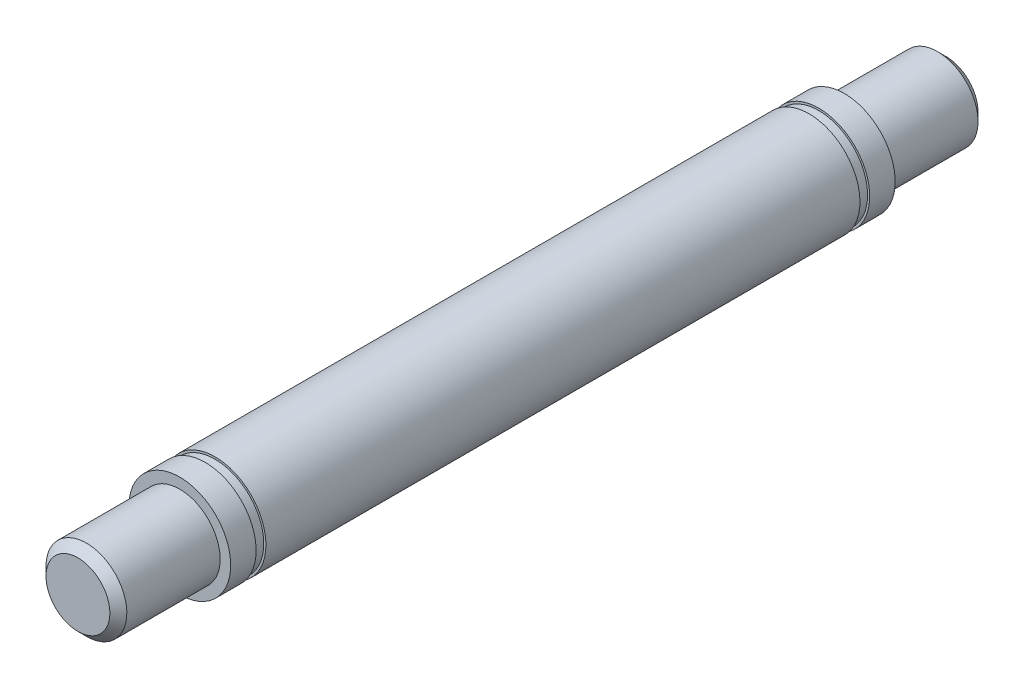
ISO-10303-21;
HEADER;
FILE_DESCRIPTION(('STEP AP214'),'2;1');
FILE_NAME('part.step','',(''),(''),'','','');
FILE_SCHEMA(('AUTOMOTIVE_DESIGN { 1 0 10303 214 1 1 1 1 }'));
ENDSEC;
DATA;
#1=APPLICATION_CONTEXT('core data for automotive mechanical design processes');
#2=APPLICATION_PROTOCOL_DEFINITION('international standard','automotive_design',2000,#1);
#3=PRODUCT_CONTEXT('',#1,'mechanical');
#4=PRODUCT('Part','Part','',(#3));
#5=PRODUCT_RELATED_PRODUCT_CATEGORY('part','',(#4));
#6=PRODUCT_DEFINITION_FORMATION('','',#4);
#7=PRODUCT_DEFINITION_CONTEXT('part definition',#1,'design');
#8=PRODUCT_DEFINITION('design','',#6,#7);
#9=PRODUCT_DEFINITION_SHAPE('','',#8);
#10=(LENGTH_UNIT() NAMED_UNIT(*) SI_UNIT(.MILLI.,.METRE.));
#11=(NAMED_UNIT(*) PLANE_ANGLE_UNIT() SI_UNIT($,.RADIAN.));
#12=(NAMED_UNIT(*) SI_UNIT($,.STERADIAN.) SOLID_ANGLE_UNIT());
#13=UNCERTAINTY_MEASURE_WITH_UNIT(LENGTH_MEASURE(1.E-05),#10,'distance_accuracy_value','');
#14=(GEOMETRIC_REPRESENTATION_CONTEXT(3) GLOBAL_UNCERTAINTY_ASSIGNED_CONTEXT((#13)) GLOBAL_UNIT_ASSIGNED_CONTEXT((#10,
#11,#12)) REPRESENTATION_CONTEXT('',''));
#15=CARTESIAN_POINT('',(0.,0.,0.));
#16=DIRECTION('',(0.,0.,1.));
#17=DIRECTION('',(1.,0.,0.));
#18=AXIS2_PLACEMENT_3D('',#15,#16,#17);
#19=CARTESIAN_POINT('',(868.104346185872,180.950151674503,51.4999999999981));
#20=DIRECTION('',(0.,0.,-1.));
#21=DIRECTION('',(-0.409810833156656,-0.912170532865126,0.));
#22=AXIS2_PLACEMENT_3D('',#19,#20,#21);
#23=PLANE('',#22);
#24=CARTESIAN_POINT('',(836.610838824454,110.850859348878,51.4999999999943));
#25=DIRECTION('',(0.,0.,1.));
#26=DIRECTION('',(0.409810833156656,0.912170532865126,0.));
#27=AXIS2_PLACEMENT_3D('',#24,#25,#26);
#28=CIRCLE('',#27,3.76250000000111);
#29=CARTESIAN_POINT('',(838.152752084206,114.282900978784,51.4999999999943));
#30=VERTEX_POINT('',#29);
#31=EDGE_CURVE('E66',#30,#30,#28,.T.);
#32=ORIENTED_EDGE('',*,*,#31,.T.);
#33=EDGE_LOOP('',(#32));
#34=FACE_BOUND('',#33,.T.);
#35=ADVANCED_FACE('F14',(#34),#23,.F.);
#36=CARTESIAN_POINT('',(868.104346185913,180.950151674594,-50.799999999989));
#37=DIRECTION('',(0.,0.,-1.));
#38=DIRECTION('',(-0.409810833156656,-0.912170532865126,0.));
#39=AXIS2_PLACEMENT_3D('',#36,#37,#38);
#40=PLANE('',#39);
#41=CARTESIAN_POINT('',(836.610838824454,110.850859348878,-50.7999999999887));
#42=DIRECTION('',(0.,0.,1.));
#43=DIRECTION('',(0.409810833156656,0.912170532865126,0.));
#44=AXIS2_PLACEMENT_3D('',#41,#42,#43);
#45=CIRCLE('',#44,3.76249999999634);
#46=CARTESIAN_POINT('',(838.152752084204,114.282900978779,-50.7999999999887));
#47=VERTEX_POINT('',#46);
#48=EDGE_CURVE('E10',#47,#47,#45,.T.);
#49=ORIENTED_EDGE('',*,*,#48,.F.);
#50=EDGE_LOOP('',(#49));
#51=FACE_BOUND('',#50,.T.);
#52=ADVANCED_FACE('F85',(#51),#40,.T.);
#53=CARTESIAN_POINT('',(836.610838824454,110.850859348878,-50.7999999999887));
#54=DIRECTION('',(0.,0.,1.));
#55=DIRECTION('',(0.409810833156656,0.912170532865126,0.));
#56=AXIS2_PLACEMENT_3D('',#53,#54,#55);
#57=CONICAL_SURFACE('',#56,3.76249999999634,0.785398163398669);
#58=CARTESIAN_POINT('',(836.610838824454,110.850859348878,-49.7999999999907));
#59=DIRECTION('',(0.,0.,1.));
#60=DIRECTION('',(0.409810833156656,0.912170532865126,0.));
#61=AXIS2_PLACEMENT_3D('',#58,#59,#60);
#62=CIRCLE('',#61,4.76249999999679);
#63=CARTESIAN_POINT('',(838.562562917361,115.195071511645,-49.7999999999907));
#64=VERTEX_POINT('',#63);
#65=EDGE_CURVE('E20',#64,#64,#62,.T.);
#66=ORIENTED_EDGE('',*,*,#65,.F.);
#67=EDGE_LOOP('',(#66));
#68=FACE_BOUND('',#67,.T.);
#69=ORIENTED_EDGE('',*,*,#48,.T.);
#70=EDGE_LOOP('',(#69));
#71=FACE_BOUND('',#70,.T.);
#72=ADVANCED_FACE('F90',(#68,#71),#57,.T.);
#73=CARTESIAN_POINT('',(836.610838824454,110.850859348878,51.5000000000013));
#74=DIRECTION('',(0.,0.,1.));
#75=DIRECTION('',(0.409810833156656,0.912170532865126,0.));
#76=AXIS2_PLACEMENT_3D('',#73,#74,#75);
#77=CYLINDRICAL_SURFACE('',#76,4.76249999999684);
#78=ORIENTED_EDGE('',*,*,#65,.T.);
#79=EDGE_LOOP('',(#78));
#80=FACE_BOUND('',#79,.T.);
#81=CARTESIAN_POINT('',(836.610838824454,110.850859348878,-38.7999999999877));
#82=DIRECTION('',(0.,0.,1.));
#83=DIRECTION('',(0.409810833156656,0.912170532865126,0.));
#84=AXIS2_PLACEMENT_3D('',#81,#82,#83);
#85=CIRCLE('',#84,4.76249999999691);
#86=CARTESIAN_POINT('',(838.562562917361,115.195071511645,-38.7999999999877));
#87=VERTEX_POINT('',#86);
#88=EDGE_CURVE('E24',#87,#87,#85,.T.);
#89=ORIENTED_EDGE('',*,*,#88,.F.);
#90=EDGE_LOOP('',(#89));
#91=FACE_BOUND('',#90,.T.);
#92=ADVANCED_FACE('F96',(#80,#91),#77,.T.);
#93=CARTESIAN_POINT('',(868.104346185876,180.950151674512,-38.799999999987));
#94=DIRECTION('',(0.,0.,1.));
#95=DIRECTION('',(0.409810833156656,0.912170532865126,0.));
#96=AXIS2_PLACEMENT_3D('',#93,#94,#95);
#97=PLANE('',#96);
#98=CARTESIAN_POINT('',(836.610838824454,110.850859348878,-38.7999999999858));
#99=DIRECTION('',(0.,0.,1.));
#100=DIRECTION('',(0.409810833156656,0.912170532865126,0.));
#101=AXIS2_PLACEMENT_3D('',#98,#99,#100);
#102=CIRCLE('',#101,6.00000000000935);
#103=CARTESIAN_POINT('',(839.069703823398,116.323882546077,-38.7999999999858));
#104=VERTEX_POINT('',#103);
#105=EDGE_CURVE('E28',#104,#104,#102,.T.);
#106=ORIENTED_EDGE('',*,*,#105,.F.);
#107=EDGE_LOOP('',(#106));
#108=FACE_BOUND('',#107,.T.);
#109=ORIENTED_EDGE('',*,*,#88,.T.);
#110=EDGE_LOOP('',(#109));
#111=FACE_BOUND('',#110,.T.);
#112=ADVANCED_FACE('F102',(#108,#111),#97,.F.);
#113=CARTESIAN_POINT('',(836.610838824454,110.850859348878,51.5000000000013));
#114=DIRECTION('',(0.,0.,1.));
#115=DIRECTION('',(0.409810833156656,0.912170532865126,0.));
#116=AXIS2_PLACEMENT_3D('',#113,#114,#115);
#117=CYLINDRICAL_SURFACE('',#116,6.00000000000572);
#118=ORIENTED_EDGE('',*,*,#105,.T.);
#119=EDGE_LOOP('',(#118));
#120=FACE_BOUND('',#119,.T.);
#121=CARTESIAN_POINT('',(836.610838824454,110.850859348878,-35.7999999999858));
#122=DIRECTION('',(0.,0.,1.));
#123=DIRECTION('',(0.409810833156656,0.912170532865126,0.));
#124=AXIS2_PLACEMENT_3D('',#121,#122,#123);
#125=CIRCLE('',#124,6.00000000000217);
#126=CARTESIAN_POINT('',(839.069703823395,116.32388254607,-35.7999999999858));
#127=VERTEX_POINT('',#126);
#128=EDGE_CURVE('E33',#127,#127,#125,.T.);
#129=ORIENTED_EDGE('',*,*,#128,.F.);
#130=EDGE_LOOP('',(#129));
#131=FACE_BOUND('',#130,.T.);
#132=ADVANCED_FACE('F105',(#120,#131),#117,.T.);
#133=CARTESIAN_POINT('',(868.104346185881,180.950151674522,-35.7999999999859));
#134=DIRECTION('',(0.,0.,1.));
#135=DIRECTION('',(0.409810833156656,0.912170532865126,0.));
#136=AXIS2_PLACEMENT_3D('',#133,#134,#135);
#137=PLANE('',#136);
#138=ORIENTED_EDGE('',*,*,#128,.T.);
#139=EDGE_LOOP('',(#138));
#140=FACE_BOUND('',#139,.T.);
#141=CARTESIAN_POINT('',(836.610838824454,110.850859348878,-35.7999999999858));
#142=DIRECTION('',(0.,0.,1.));
#143=DIRECTION('',(0.409810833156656,0.912170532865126,0.));
#144=AXIS2_PLACEMENT_3D('',#141,#142,#143);
#145=CIRCLE('',#144,5.75000000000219);
#146=CARTESIAN_POINT('',(838.967251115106,116.095839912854,-35.7999999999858));
#147=VERTEX_POINT('',#146);
#148=EDGE_CURVE('E36',#147,#147,#145,.T.);
#149=ORIENTED_EDGE('',*,*,#148,.F.);
#150=EDGE_LOOP('',(#149));
#151=FACE_BOUND('',#150,.T.);
#152=ADVANCED_FACE('F109',(#140,#151),#137,.T.);
#153=CARTESIAN_POINT('',(836.610838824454,110.850859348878,51.5000000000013));
#154=DIRECTION('',(0.,0.,1.));
#155=DIRECTION('',(0.409810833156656,0.912170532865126,0.));
#156=AXIS2_PLACEMENT_3D('',#153,#154,#155);
#157=CYLINDRICAL_SURFACE('',#156,5.75000000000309);
#158=CARTESIAN_POINT('',(836.610838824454,110.850859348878,-34.6499999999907));
#159=DIRECTION('',(0.,0.,1.));
#160=DIRECTION('',(0.409810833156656,0.912170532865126,0.));
#161=AXIS2_PLACEMENT_3D('',#158,#159,#160);
#162=CIRCLE('',#161,5.75000000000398);
#163=CARTESIAN_POINT('',(838.967251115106,116.095839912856,-34.6499999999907));
#164=VERTEX_POINT('',#163);
#165=EDGE_CURVE('E39',#164,#164,#162,.T.);
#166=ORIENTED_EDGE('',*,*,#165,.F.);
#167=EDGE_LOOP('',(#166));
#168=FACE_BOUND('',#167,.T.);
#169=ORIENTED_EDGE('',*,*,#148,.T.);
#170=EDGE_LOOP('',(#169));
#171=FACE_BOUND('',#170,.T.);
#172=ADVANCED_FACE('F113',(#168,#171),#157,.T.);
#173=CARTESIAN_POINT('',(868.104346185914,180.950151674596,-34.649999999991));
#174=DIRECTION('',(0.,0.,-1.));
#175=DIRECTION('',(-0.409810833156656,-0.912170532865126,0.));
#176=AXIS2_PLACEMENT_3D('',#173,#174,#175);
#177=PLANE('',#176);
#178=ORIENTED_EDGE('',*,*,#165,.T.);
#179=EDGE_LOOP('',(#178));
#180=FACE_BOUND('',#179,.T.);
#181=CARTESIAN_POINT('',(836.610838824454,110.850859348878,-34.6499999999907));
#182=DIRECTION('',(0.,0.,1.));
#183=DIRECTION('',(0.409810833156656,0.912170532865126,0.));
#184=AXIS2_PLACEMENT_3D('',#181,#182,#183);
#185=CIRCLE('',#184,6.00000000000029);
#186=CARTESIAN_POINT('',(839.069703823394,116.323882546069,-34.6499999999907));
#187=VERTEX_POINT('',#186);
#188=EDGE_CURVE('E42',#187,#187,#185,.T.);
#189=ORIENTED_EDGE('',*,*,#188,.F.);
#190=EDGE_LOOP('',(#189));
#191=FACE_BOUND('',#190,.T.);
#192=ADVANCED_FACE('F117',(#180,#191),#177,.T.);
#193=CARTESIAN_POINT('',(836.610838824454,110.850859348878,51.5000000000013));
#194=DIRECTION('',(0.,0.,1.));
#195=DIRECTION('',(0.409810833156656,0.912170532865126,0.));
#196=AXIS2_PLACEMENT_3D('',#193,#194,#195);
#197=CYLINDRICAL_SURFACE('',#196,6.00000000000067);
#198=ORIENTED_EDGE('',*,*,#188,.T.);
#199=EDGE_LOOP('',(#198));
#200=FACE_BOUND('',#199,.T.);
#201=CARTESIAN_POINT('',(836.610838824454,110.850859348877,35.3500000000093));
#202=DIRECTION('',(0.,0.,1.));
#203=DIRECTION('',(0.409810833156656,0.912170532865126,0.));
#204=AXIS2_PLACEMENT_3D('',#201,#202,#203);
#205=CIRCLE('',#204,6.00000000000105);
#206=CARTESIAN_POINT('',(839.069703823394,116.323882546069,35.3500000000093));
#207=VERTEX_POINT('',#206);
#208=EDGE_CURVE('E45',#207,#207,#205,.T.);
#209=ORIENTED_EDGE('',*,*,#208,.F.);
#210=EDGE_LOOP('',(#209));
#211=FACE_BOUND('',#210,.T.);
#212=ADVANCED_FACE('F121',(#200,#211),#197,.T.);
#213=CARTESIAN_POINT('',(868.104346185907,180.95015167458,35.3500000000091));
#214=DIRECTION('',(0.,0.,-1.));
#215=DIRECTION('',(-0.409810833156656,-0.912170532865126,0.));
#216=AXIS2_PLACEMENT_3D('',#213,#214,#215);
#217=PLANE('',#216);
#218=CARTESIAN_POINT('',(836.610838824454,110.850859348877,35.3500000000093));
#219=DIRECTION('',(0.,0.,1.));
#220=DIRECTION('',(0.409810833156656,0.912170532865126,0.));
#221=AXIS2_PLACEMENT_3D('',#218,#219,#220);
#222=CIRCLE('',#221,5.75000000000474);
#223=CARTESIAN_POINT('',(838.967251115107,116.095839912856,35.3500000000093));
#224=VERTEX_POINT('',#223);
#225=EDGE_CURVE('E48',#224,#224,#222,.T.);
#226=ORIENTED_EDGE('',*,*,#225,.F.);
#227=EDGE_LOOP('',(#226));
#228=FACE_BOUND('',#227,.T.);
#229=ORIENTED_EDGE('',*,*,#208,.T.);
#230=EDGE_LOOP('',(#229));
#231=FACE_BOUND('',#230,.T.);
#232=ADVANCED_FACE('F125',(#228,#231),#217,.F.);
#233=CARTESIAN_POINT('',(836.610838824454,110.850859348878,51.5000000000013));
#234=DIRECTION('',(0.,0.,1.));
#235=DIRECTION('',(0.409810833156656,0.912170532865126,0.));
#236=AXIS2_PLACEMENT_3D('',#233,#234,#235);
#237=CYLINDRICAL_SURFACE('',#236,5.75000000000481);
#238=CARTESIAN_POINT('',(836.610838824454,110.850859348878,36.5000000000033));
#239=DIRECTION('',(0.,0.,1.));
#240=DIRECTION('',(0.409810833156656,0.912170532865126,0.));
#241=AXIS2_PLACEMENT_3D('',#238,#239,#240);
#242=CIRCLE('',#241,5.75000000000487);
#243=CARTESIAN_POINT('',(838.967251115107,116.095839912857,36.5000000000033));
#244=VERTEX_POINT('',#243);
#245=EDGE_CURVE('E51',#244,#244,#242,.T.);
#246=ORIENTED_EDGE('',*,*,#245,.F.);
#247=EDGE_LOOP('',(#246));
#248=FACE_BOUND('',#247,.T.);
#249=ORIENTED_EDGE('',*,*,#225,.T.);
#250=EDGE_LOOP('',(#249));
#251=FACE_BOUND('',#250,.T.);
#252=ADVANCED_FACE('F129',(#248,#251),#237,.T.);
#253=CARTESIAN_POINT('',(868.104346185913,180.950151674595,36.5000000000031));
#254=DIRECTION('',(0.,0.,-1.));
#255=DIRECTION('',(-0.409810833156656,-0.912170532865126,0.));
#256=AXIS2_PLACEMENT_3D('',#253,#254,#255);
#257=PLANE('',#256);
#258=ORIENTED_EDGE('',*,*,#245,.T.);
#259=EDGE_LOOP('',(#258));
#260=FACE_BOUND('',#259,.T.);
#261=CARTESIAN_POINT('',(836.610838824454,110.850859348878,36.5000000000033));
#262=DIRECTION('',(0.,0.,1.));
#263=DIRECTION('',(0.409810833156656,0.912170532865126,0.));
#264=AXIS2_PLACEMENT_3D('',#261,#262,#263);
#265=CIRCLE('',#264,6.00000000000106);
#266=CARTESIAN_POINT('',(839.069703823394,116.32388254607,36.5000000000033));
#267=VERTEX_POINT('',#266);
#268=EDGE_CURVE('E54',#267,#267,#265,.T.);
#269=ORIENTED_EDGE('',*,*,#268,.F.);
#270=EDGE_LOOP('',(#269));
#271=FACE_BOUND('',#270,.T.);
#272=ADVANCED_FACE('F133',(#260,#271),#257,.T.);
#273=CARTESIAN_POINT('',(836.610838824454,110.850859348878,51.5000000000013));
#274=DIRECTION('',(0.,0.,1.));
#275=DIRECTION('',(0.409810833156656,0.912170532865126,0.));
#276=AXIS2_PLACEMENT_3D('',#273,#274,#275);
#277=CYLINDRICAL_SURFACE('',#276,6.00000000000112);
#278=ORIENTED_EDGE('',*,*,#268,.T.);
#279=EDGE_LOOP('',(#278));
#280=FACE_BOUND('',#279,.T.);
#281=CARTESIAN_POINT('',(836.610838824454,110.850859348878,39.5000000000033));
#282=DIRECTION('',(0.,0.,1.));
#283=DIRECTION('',(0.409810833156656,0.912170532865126,0.));
#284=AXIS2_PLACEMENT_3D('',#281,#282,#283);
#285=CIRCLE('',#284,6.0000000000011);
#286=CARTESIAN_POINT('',(839.069703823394,116.32388254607,39.5000000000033));
#287=VERTEX_POINT('',#286);
#288=EDGE_CURVE('E57',#287,#287,#285,.T.);
#289=ORIENTED_EDGE('',*,*,#288,.F.);
#290=EDGE_LOOP('',(#289));
#291=FACE_BOUND('',#290,.T.);
#292=ADVANCED_FACE('F137',(#280,#291),#277,.T.);
#293=CARTESIAN_POINT('',(868.104346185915,180.950151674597,39.5000000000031));
#294=DIRECTION('',(0.,0.,-1.));
#295=DIRECTION('',(-0.409810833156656,-0.912170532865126,0.));
#296=AXIS2_PLACEMENT_3D('',#293,#294,#295);
#297=PLANE('',#296);
#298=CARTESIAN_POINT('',(836.610838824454,110.850859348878,39.5000000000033));
#299=DIRECTION('',(0.,0.,1.));
#300=DIRECTION('',(0.409810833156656,0.912170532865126,0.));
#301=AXIS2_PLACEMENT_3D('',#298,#299,#300);
#302=CIRCLE('',#301,4.76250000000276);
#303=CARTESIAN_POINT('',(838.562562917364,115.19507151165,39.5000000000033));
#304=VERTEX_POINT('',#303);
#305=EDGE_CURVE('E60',#304,#304,#302,.T.);
#306=ORIENTED_EDGE('',*,*,#305,.F.);
#307=EDGE_LOOP('',(#306));
#308=FACE_BOUND('',#307,.T.);
#309=ORIENTED_EDGE('',*,*,#288,.T.);
#310=EDGE_LOOP('',(#309));
#311=FACE_BOUND('',#310,.T.);
#312=ADVANCED_FACE('F81',(#308,#311),#297,.F.);
#313=CARTESIAN_POINT('',(836.610838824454,110.850859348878,51.5000000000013));
#314=DIRECTION('',(0.,0.,1.));
#315=DIRECTION('',(0.409810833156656,0.912170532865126,0.));
#316=AXIS2_PLACEMENT_3D('',#313,#314,#315);
#317=CYLINDRICAL_SURFACE('',#316,4.76250000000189);
#318=ORIENTED_EDGE('',*,*,#305,.T.);
#319=EDGE_LOOP('',(#318));
#320=FACE_BOUND('',#319,.T.);
#321=CARTESIAN_POINT('',(836.610838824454,110.850859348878,50.4999999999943));
#322=DIRECTION('',(0.,0.,1.));
#323=DIRECTION('',(0.409810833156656,0.912170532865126,0.));
#324=AXIS2_PLACEMENT_3D('',#321,#322,#323);
#325=CIRCLE('',#324,4.76250000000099);
#326=CARTESIAN_POINT('',(838.562562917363,115.195071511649,50.4999999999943));
#327=VERTEX_POINT('',#326);
#328=EDGE_CURVE('E63',#327,#327,#325,.T.);
#329=ORIENTED_EDGE('',*,*,#328,.F.);
#330=EDGE_LOOP('',(#329));
#331=FACE_BOUND('',#330,.T.);
#332=ADVANCED_FACE('F73',(#320,#331),#317,.T.);
#333=CARTESIAN_POINT('',(836.610838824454,110.850859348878,51.4999999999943));
#334=DIRECTION('',(0.,0.,-1.));
#335=DIRECTION('',(-0.409810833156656,-0.912170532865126,0.));
#336=AXIS2_PLACEMENT_3D('',#333,#334,#335);
#337=CONICAL_SURFACE('',#336,3.76250000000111,0.785398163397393);
#338=ORIENTED_EDGE('',*,*,#328,.T.);
#339=EDGE_LOOP('',(#338));
#340=FACE_BOUND('',#339,.T.);
#341=ORIENTED_EDGE('',*,*,#31,.F.);
#342=EDGE_LOOP('',(#341));
#343=FACE_BOUND('',#342,.T.);
#344=ADVANCED_FACE('F71',(#340,#343),#337,.T.);
#345=CLOSED_SHELL('',(#35,#52,#72,#92,#112,#132,#152,#172,#192,#212,#232,#252,#272,#292,#312,
#332,#344));
#346=MANIFOLD_SOLID_BREP('B1',#345);
#347=ADVANCED_BREP_SHAPE_REPRESENTATION('',(#18,#346),#14);
#348=SHAPE_DEFINITION_REPRESENTATION(#9,#347);
ENDSEC;
END-ISO-10303-21;
